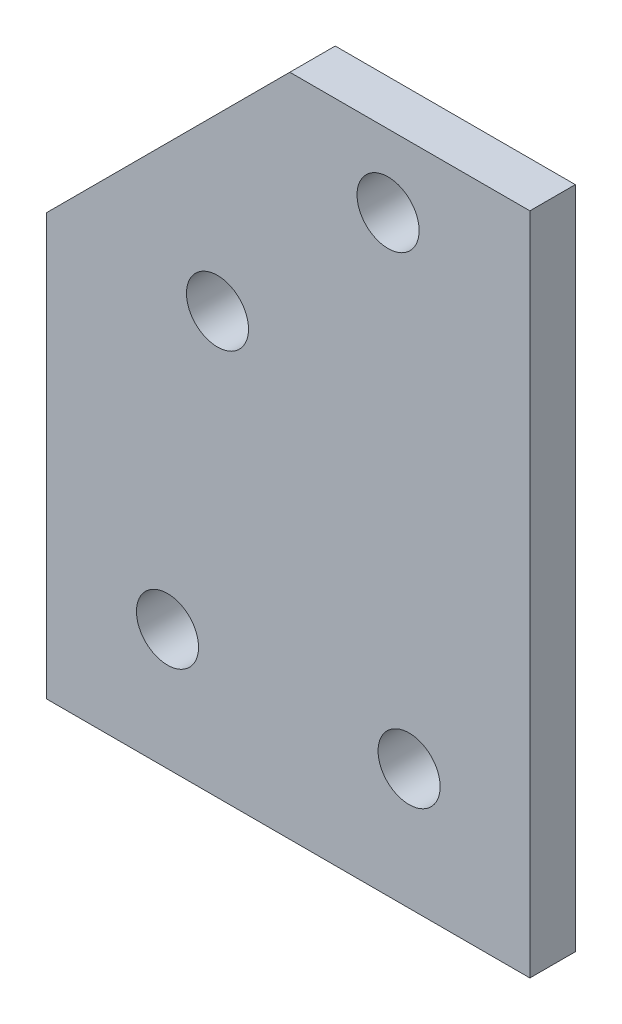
from build123d import *

# Parameters (mm, degrees)
SKETCH1_R           = 3.2639
BOSS_EXTRUDE1_DEPTH = 4.7752


with BuildPart() as part:
    # Sketch1 → Boss-Extrude1 (new body)
    with BuildSketch(Plane.XY):
        Polygon((-25.4, 0), (25.4, 0), (25.4, 69.85), (0.16002, 69.85), (-25.4, 44.28998), align=None)
        with Locations((12.7, 12.7)):
            Circle(SKETCH1_R, mode=Mode.SUBTRACT)
        with Locations((10.4902, 62.22492)):
            Circle(SKETCH1_R, mode=Mode.SUBTRACT)
        with Locations((-7.44474, 44.28998)):
            Circle(SKETCH1_R, mode=Mode.SUBTRACT)
        with Locations((-12.7, 12.7)):
            Circle(SKETCH1_R, mode=Mode.SUBTRACT)
    extrude(amount=BOSS_EXTRUDE1_DEPTH)


solid = part.part
